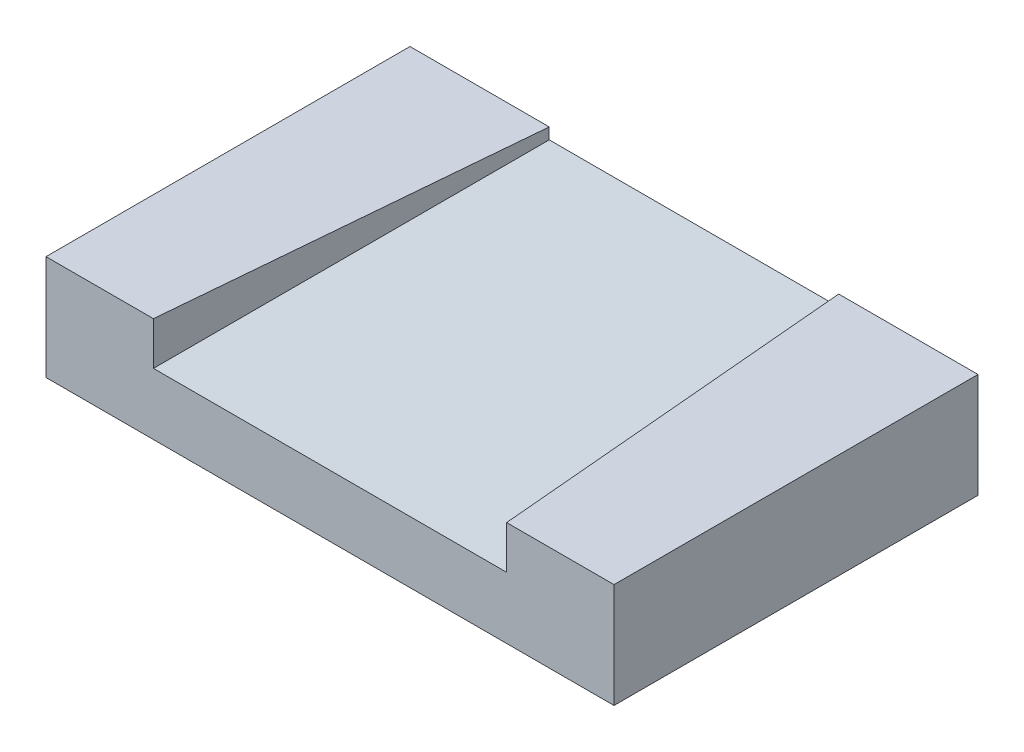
ISO-10303-21;
HEADER;
FILE_DESCRIPTION(('STEP AP214'),'2;1');
FILE_NAME('part.step','',(''),(''),'','','');
FILE_SCHEMA(('AUTOMOTIVE_DESIGN { 1 0 10303 214 1 1 1 1 }'));
ENDSEC;
DATA;
#1=APPLICATION_CONTEXT('core data for automotive mechanical design processes');
#2=APPLICATION_PROTOCOL_DEFINITION('international standard','automotive_design',2000,#1);
#3=PRODUCT_CONTEXT('',#1,'mechanical');
#4=PRODUCT('Part','Part','',(#3));
#5=PRODUCT_RELATED_PRODUCT_CATEGORY('part','',(#4));
#6=PRODUCT_DEFINITION_FORMATION('','',#4);
#7=PRODUCT_DEFINITION_CONTEXT('part definition',#1,'design');
#8=PRODUCT_DEFINITION('design','',#6,#7);
#9=PRODUCT_DEFINITION_SHAPE('','',#8);
#10=(LENGTH_UNIT() NAMED_UNIT(*) SI_UNIT(.MILLI.,.METRE.));
#11=(NAMED_UNIT(*) PLANE_ANGLE_UNIT() SI_UNIT($,.RADIAN.));
#12=(NAMED_UNIT(*) SI_UNIT($,.STERADIAN.) SOLID_ANGLE_UNIT());
#13=UNCERTAINTY_MEASURE_WITH_UNIT(LENGTH_MEASURE(1.E-05),#10,'distance_accuracy_value','');
#14=(GEOMETRIC_REPRESENTATION_CONTEXT(3) GLOBAL_UNCERTAINTY_ASSIGNED_CONTEXT((#13)) GLOBAL_UNIT_ASSIGNED_CONTEXT((#10,
#11,#12)) REPRESENTATION_CONTEXT('',''));
#15=CARTESIAN_POINT('',(0.,0.,0.));
#16=DIRECTION('',(0.,0.,1.));
#17=DIRECTION('',(1.,0.,0.));
#18=AXIS2_PLACEMENT_3D('',#15,#16,#17);
#19=CARTESIAN_POINT('',(-86.7956107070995,32.,55.6146576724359));
#20=DIRECTION('',(0.,1.,0.));
#21=DIRECTION('',(0.,0.,1.));
#22=AXIS2_PLACEMENT_3D('',#19,#20,#21);
#23=PLANE('',#22);
#24=DIRECTION('',(-0.0871557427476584,0.,0.996194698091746));
#25=VECTOR('',#24,1.);
#26=CARTESIAN_POINT('',(-54.2132274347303,32.,58.4652468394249));
#27=LINE('',#26,#25);
#28=CARTESIAN_POINT('',(-44.2325290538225,32.,-55.6146576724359));
#29=VERTEX_POINT('',#28);
#30=CARTESIAN_POINT('',(-53.9638331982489,32.,55.6146576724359));
#31=VERTEX_POINT('',#30);
#32=EDGE_CURVE('E11',#29,#31,#27,.T.);
#33=ORIENTED_EDGE('',*,*,#32,.F.);
#34=DIRECTION('',(-1.,0.,0.));
#35=VECTOR('',#34,1.);
#36=CARTESIAN_POINT('',(-86.7956107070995,32.,-55.6146576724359));
#37=LINE('',#36,#35);
#38=CARTESIAN_POINT('',(-86.7956107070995,32.,-55.6146576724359));
#39=VERTEX_POINT('',#38);
#40=EDGE_CURVE('E50',#29,#39,#37,.T.);
#41=ORIENTED_EDGE('',*,*,#40,.T.);
#42=DIRECTION('',(0.,0.,1.));
#43=VECTOR('',#42,1.);
#44=CARTESIAN_POINT('',(-86.7956107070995,32.,-55.6146576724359));
#45=LINE('',#44,#43);
#46=CARTESIAN_POINT('',(-86.7956107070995,32.,55.6146576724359));
#47=VERTEX_POINT('',#46);
#48=EDGE_CURVE('E131',#39,#47,#45,.T.);
#49=ORIENTED_EDGE('',*,*,#48,.T.);
#50=DIRECTION('',(1.,0.,0.));
#51=VECTOR('',#50,1.);
#52=CARTESIAN_POINT('',(-86.7956107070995,32.,55.6146576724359));
#53=LINE('',#52,#51);
#54=EDGE_CURVE('E134',#47,#31,#53,.T.);
#55=ORIENTED_EDGE('',*,*,#54,.T.);
#56=EDGE_LOOP('',(#33,#41,#49,#55));
#57=FACE_BOUND('',#56,.T.);
#58=ADVANCED_FACE('F27',(#57),#23,.T.);
#59=CARTESIAN_POINT('',(-86.7956107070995,32.,-55.6146576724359));
#60=DIRECTION('',(1.,0.,0.));
#61=DIRECTION('',(0.,0.,-1.));
#62=AXIS2_PLACEMENT_3D('',#59,#60,#61);
#63=PLANE('',#62);
#64=DIRECTION('',(0.,0.,1.));
#65=VECTOR('',#64,1.);
#66=CARTESIAN_POINT('',(-86.7956107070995,0.,-55.6146576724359));
#67=LINE('',#66,#65);
#68=CARTESIAN_POINT('',(-86.7956107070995,0.,-55.6146576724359));
#69=VERTEX_POINT('',#68);
#70=CARTESIAN_POINT('',(-86.7956107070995,0.,55.6146576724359));
#71=VERTEX_POINT('',#70);
#72=EDGE_CURVE('E118',#69,#71,#67,.T.);
#73=ORIENTED_EDGE('',*,*,#72,.T.);
#74=DIRECTION('',(0.,-1.,0.));
#75=VECTOR('',#74,1.);
#76=CARTESIAN_POINT('',(-86.7956107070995,32.,55.6146576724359));
#77=LINE('',#76,#75);
#78=EDGE_CURVE('E150',#47,#71,#77,.T.);
#79=ORIENTED_EDGE('',*,*,#78,.F.);
#80=ORIENTED_EDGE('',*,*,#48,.F.);
#81=DIRECTION('',(0.,-1.,0.));
#82=VECTOR('',#81,1.);
#83=CARTESIAN_POINT('',(-86.7956107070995,32.,-55.6146576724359));
#84=LINE('',#83,#82);
#85=EDGE_CURVE('E141',#39,#69,#84,.T.);
#86=ORIENTED_EDGE('',*,*,#85,.T.);
#87=EDGE_LOOP('',(#73,#79,#80,#86));
#88=FACE_BOUND('',#87,.T.);
#89=ADVANCED_FACE('F29',(#88),#63,.F.);
#90=CARTESIAN_POINT('',(-86.7956107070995,32.,55.6146576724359));
#91=DIRECTION('',(0.,0.,-1.));
#92=DIRECTION('',(-1.,0.,0.));
#93=AXIS2_PLACEMENT_3D('',#90,#91,#92);
#94=PLANE('',#93);
#95=DIRECTION('',(1.,0.,0.));
#96=VECTOR('',#95,1.);
#97=CARTESIAN_POINT('',(-53.9638331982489,18.8424539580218,55.6146576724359));
#98=LINE('',#97,#96);
#99=CARTESIAN_POINT('',(-53.9638331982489,18.8424539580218,55.6146576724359));
#100=VERTEX_POINT('',#99);
#101=CARTESIAN_POINT('',(53.9638331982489,18.8424539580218,55.6146576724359));
#102=VERTEX_POINT('',#101);
#103=EDGE_CURVE('E100',#100,#102,#98,.T.);
#104=ORIENTED_EDGE('',*,*,#103,.F.);
#105=DIRECTION('',(0.,-1.,0.));
#106=VECTOR('',#105,1.);
#107=CARTESIAN_POINT('',(-53.9638331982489,43.9070926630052,55.6146576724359));
#108=LINE('',#107,#106);
#109=EDGE_CURVE('E92',#31,#100,#108,.T.);
#110=ORIENTED_EDGE('',*,*,#109,.F.);
#111=ORIENTED_EDGE('',*,*,#54,.F.);
#112=ORIENTED_EDGE('',*,*,#78,.T.);
#113=DIRECTION('',(1.,0.,0.));
#114=VECTOR('',#113,1.);
#115=CARTESIAN_POINT('',(-86.7956107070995,0.,55.6146576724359));
#116=LINE('',#115,#114);
#117=CARTESIAN_POINT('',(86.7956107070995,0.,55.6146576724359));
#118=VERTEX_POINT('',#117);
#119=EDGE_CURVE('E125',#71,#118,#116,.T.);
#120=ORIENTED_EDGE('',*,*,#119,.T.);
#121=DIRECTION('',(0.,-1.,0.));
#122=VECTOR('',#121,1.);
#123=CARTESIAN_POINT('',(86.7956107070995,32.,55.6146576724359));
#124=LINE('',#123,#122);
#125=CARTESIAN_POINT('',(86.7956107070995,32.,55.6146576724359));
#126=VERTEX_POINT('',#125);
#127=EDGE_CURVE('E147',#126,#118,#124,.T.);
#128=ORIENTED_EDGE('',*,*,#127,.F.);
#129=CARTESIAN_POINT('',(53.963833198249,32.,55.6146576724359));
#130=VERTEX_POINT('',#129);
#131=EDGE_CURVE('E133',#130,#126,#53,.T.);
#132=ORIENTED_EDGE('',*,*,#131,.F.);
#133=DIRECTION('',(0.,1.,0.));
#134=VECTOR('',#133,1.);
#135=CARTESIAN_POINT('',(53.9638331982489,43.9070926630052,55.6146576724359));
#136=LINE('',#135,#134);
#137=EDGE_CURVE('E42',#102,#130,#136,.T.);
#138=ORIENTED_EDGE('',*,*,#137,.F.);
#139=EDGE_LOOP('',(#104,#110,#111,#112,#120,#128,#132,#138));
#140=FACE_BOUND('',#139,.T.);
#141=ADVANCED_FACE('F111',(#140),#94,.F.);
#142=CARTESIAN_POINT('',(86.7956107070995,32.,-55.6146576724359));
#143=DIRECTION('',(-1.,0.,0.));
#144=DIRECTION('',(0.,0.,1.));
#145=AXIS2_PLACEMENT_3D('',#142,#143,#144);
#146=PLANE('',#145);
#147=DIRECTION('',(0.,0.,-1.));
#148=VECTOR('',#147,1.);
#149=CARTESIAN_POINT('',(86.7956107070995,0.,-55.6146576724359));
#150=LINE('',#149,#148);
#151=CARTESIAN_POINT('',(86.7956107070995,0.,-55.6146576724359));
#152=VERTEX_POINT('',#151);
#153=EDGE_CURVE('E127',#118,#152,#150,.T.);
#154=ORIENTED_EDGE('',*,*,#153,.T.);
#155=DIRECTION('',(0.,-1.,0.));
#156=VECTOR('',#155,1.);
#157=CARTESIAN_POINT('',(86.7956107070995,32.,-55.6146576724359));
#158=LINE('',#157,#156);
#159=CARTESIAN_POINT('',(86.7956107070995,32.,-55.6146576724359));
#160=VERTEX_POINT('',#159);
#161=EDGE_CURVE('E144',#160,#152,#158,.T.);
#162=ORIENTED_EDGE('',*,*,#161,.F.);
#163=DIRECTION('',(0.,0.,-1.));
#164=VECTOR('',#163,1.);
#165=CARTESIAN_POINT('',(86.7956107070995,32.,-55.6146576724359));
#166=LINE('',#165,#164);
#167=EDGE_CURVE('E136',#126,#160,#166,.T.);
#168=ORIENTED_EDGE('',*,*,#167,.F.);
#169=ORIENTED_EDGE('',*,*,#127,.T.);
#170=EDGE_LOOP('',(#154,#162,#168,#169));
#171=FACE_BOUND('',#170,.T.);
#172=ADVANCED_FACE('F163',(#171),#146,.F.);
#173=CARTESIAN_POINT('',(-86.7956107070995,32.,-55.6146576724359));
#174=DIRECTION('',(0.,0.,1.));
#175=DIRECTION('',(1.,0.,0.));
#176=AXIS2_PLACEMENT_3D('',#173,#174,#175);
#177=PLANE('',#176);
#178=ORIENTED_EDGE('',*,*,#40,.F.);
#179=DIRECTION('',(0.,-1.,0.));
#180=VECTOR('',#179,1.);
#181=CARTESIAN_POINT('',(-44.2325290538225,18.8424539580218,-55.6146576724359));
#182=LINE('',#181,#180);
#183=CARTESIAN_POINT('',(-44.2325290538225,28.5737581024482,-55.6146576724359));
#184=VERTEX_POINT('',#183);
#185=EDGE_CURVE('E114',#29,#184,#182,.T.);
#186=ORIENTED_EDGE('',*,*,#185,.T.);
#187=DIRECTION('',(1.,0.,0.));
#188=VECTOR('',#187,1.);
#189=CARTESIAN_POINT('',(-53.9638331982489,28.5737581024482,-55.6146576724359));
#190=LINE('',#189,#188);
#191=CARTESIAN_POINT('',(44.2325290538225,28.5737581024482,-55.6146576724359));
#192=VERTEX_POINT('',#191);
#193=EDGE_CURVE('E106',#184,#192,#190,.T.);
#194=ORIENTED_EDGE('',*,*,#193,.T.);
#195=DIRECTION('',(0.,1.,0.));
#196=VECTOR('',#195,1.);
#197=CARTESIAN_POINT('',(44.2325290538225,18.8424539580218,-55.6146576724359));
#198=LINE('',#197,#196);
#199=CARTESIAN_POINT('',(44.2325290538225,32.,-55.6146576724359));
#200=VERTEX_POINT('',#199);
#201=EDGE_CURVE('E109',#192,#200,#198,.T.);
#202=ORIENTED_EDGE('',*,*,#201,.T.);
#203=EDGE_CURVE('E138',#160,#200,#37,.T.);
#204=ORIENTED_EDGE('',*,*,#203,.F.);
#205=ORIENTED_EDGE('',*,*,#161,.T.);
#206=DIRECTION('',(-1.,0.,0.));
#207=VECTOR('',#206,1.);
#208=CARTESIAN_POINT('',(-86.7956107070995,0.,-55.6146576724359));
#209=LINE('',#208,#207);
#210=EDGE_CURVE('E129',#152,#69,#209,.T.);
#211=ORIENTED_EDGE('',*,*,#210,.T.);
#212=ORIENTED_EDGE('',*,*,#85,.F.);
#213=EDGE_LOOP('',(#178,#186,#194,#202,#204,#205,#211,#212));
#214=FACE_BOUND('',#213,.T.);
#215=ADVANCED_FACE('F157',(#214),#177,.F.);
#216=DIRECTION('',(-0.0871557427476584,0.,-0.996194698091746));
#217=VECTOR('',#216,1.);
#218=CARTESIAN_POINT('',(52.8946070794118,32.,43.3933472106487));
#219=LINE('',#218,#217);
#220=EDGE_CURVE('E35',#130,#200,#219,.T.);
#221=ORIENTED_EDGE('',*,*,#220,.F.);
#222=ORIENTED_EDGE('',*,*,#131,.T.);
#223=ORIENTED_EDGE('',*,*,#167,.T.);
#224=ORIENTED_EDGE('',*,*,#203,.T.);
#225=EDGE_LOOP('',(#221,#222,#223,#224));
#226=FACE_BOUND('',#225,.T.);
#227=ADVANCED_FACE('F158',(#226),#23,.T.);
#228=CARTESIAN_POINT('',(-86.7956107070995,0.,55.6146576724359));
#229=DIRECTION('',(0.,1.,0.));
#230=DIRECTION('',(0.,0.,1.));
#231=AXIS2_PLACEMENT_3D('',#228,#229,#230);
#232=PLANE('',#231);
#233=ORIENTED_EDGE('',*,*,#72,.F.);
#234=ORIENTED_EDGE('',*,*,#210,.F.);
#235=ORIENTED_EDGE('',*,*,#153,.F.);
#236=ORIENTED_EDGE('',*,*,#119,.F.);
#237=EDGE_LOOP('',(#233,#234,#235,#236));
#238=FACE_BOUND('',#237,.T.);
#239=ADVANCED_FACE('F168',(#238),#232,.F.);
#240=CARTESIAN_POINT('',(-53.9638331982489,43.9070926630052,55.6146576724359));
#241=DIRECTION('',(-0.996194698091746,0.,-0.0871557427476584));
#242=DIRECTION('',(-0.0871557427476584,0.,0.996194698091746));
#243=AXIS2_PLACEMENT_3D('',#240,#241,#242);
#244=PLANE('',#243);
#245=ORIENTED_EDGE('',*,*,#32,.T.);
#246=ORIENTED_EDGE('',*,*,#109,.T.);
#247=DIRECTION('',(-0.0868265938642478,-0.0868265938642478,0.992432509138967));
#248=VECTOR('',#247,1.);
#249=CARTESIAN_POINT('',(-53.7748744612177,19.031412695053,53.4548494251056));
#250=LINE('',#249,#248);
#251=EDGE_CURVE('E95',#184,#100,#250,.T.);
#252=ORIENTED_EDGE('',*,*,#251,.F.);
#253=ORIENTED_EDGE('',*,*,#185,.F.);
#254=EDGE_LOOP('',(#245,#246,#252,#253));
#255=FACE_BOUND('',#254,.T.);
#256=ADVANCED_FACE('F94',(#255),#244,.F.);
#257=CARTESIAN_POINT('',(53.9638331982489,43.9070926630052,55.6146576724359));
#258=DIRECTION('',(0.996194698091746,0.,-0.0871557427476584));
#259=DIRECTION('',(-0.0871557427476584,0.,-0.996194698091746));
#260=AXIS2_PLACEMENT_3D('',#257,#258,#259);
#261=PLANE('',#260);
#262=ORIENTED_EDGE('',*,*,#220,.T.);
#263=ORIENTED_EDGE('',*,*,#201,.F.);
#264=DIRECTION('',(0.0868265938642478,-0.0868265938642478,0.992432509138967));
#265=VECTOR('',#264,1.);
#266=CARTESIAN_POINT('',(53.1501819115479,19.6561052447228,46.3145809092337));
#267=LINE('',#266,#265);
#268=EDGE_CURVE('E108',#192,#102,#267,.T.);
#269=ORIENTED_EDGE('',*,*,#268,.T.);
#270=ORIENTED_EDGE('',*,*,#137,.T.);
#271=EDGE_LOOP('',(#262,#263,#269,#270));
#272=FACE_BOUND('',#271,.T.);
#273=ADVANCED_FACE('F153',(#272),#261,.F.);
#274=CARTESIAN_POINT('',(-53.9638331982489,18.8424539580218,55.6146576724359));
#275=DIRECTION('',(0.,-0.996194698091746,-0.0871557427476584));
#276=DIRECTION('',(0.,0.0871557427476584,-0.996194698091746));
#277=AXIS2_PLACEMENT_3D('',#274,#275,#276);
#278=PLANE('',#277);
#279=ORIENTED_EDGE('',*,*,#103,.T.);
#280=ORIENTED_EDGE('',*,*,#268,.F.);
#281=ORIENTED_EDGE('',*,*,#193,.F.);
#282=ORIENTED_EDGE('',*,*,#251,.T.);
#283=EDGE_LOOP('',(#279,#280,#281,#282));
#284=FACE_BOUND('',#283,.T.);
#285=ADVANCED_FACE('F104',(#284),#278,.F.);
#286=CLOSED_SHELL('',(#58,#89,#141,#172,#215,#227,#239,#256,#273,#285));
#287=MANIFOLD_SOLID_BREP('B2',#286);
#288=ADVANCED_BREP_SHAPE_REPRESENTATION('',(#18,#287),#14);
#289=SHAPE_DEFINITION_REPRESENTATION(#9,#288);
ENDSEC;
END-ISO-10303-21;
